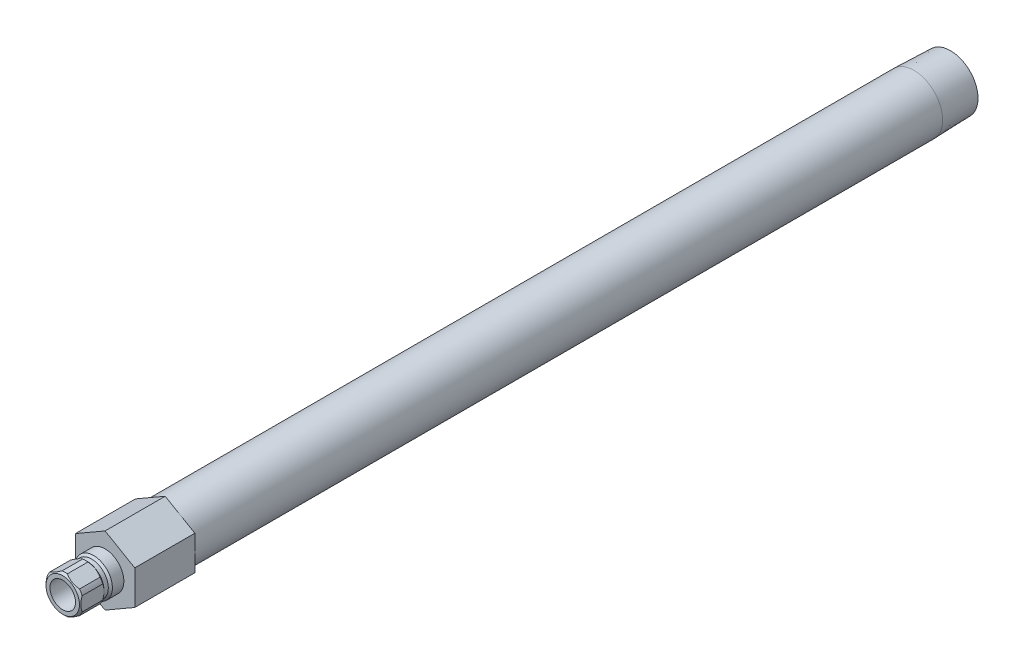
ISO-10303-21;
HEADER;
FILE_DESCRIPTION(('STEP AP214'),'2;1');
FILE_NAME('part.step','',(''),(''),'','','');
FILE_SCHEMA(('AUTOMOTIVE_DESIGN { 1 0 10303 214 1 1 1 1 }'));
ENDSEC;
DATA;
#1=APPLICATION_CONTEXT('core data for automotive mechanical design processes');
#2=APPLICATION_PROTOCOL_DEFINITION('international standard','automotive_design',2000,#1);
#3=PRODUCT_CONTEXT('',#1,'mechanical');
#4=PRODUCT('Part','Part','',(#3));
#5=PRODUCT_RELATED_PRODUCT_CATEGORY('part','',(#4));
#6=PRODUCT_DEFINITION_FORMATION('','',#4);
#7=PRODUCT_DEFINITION_CONTEXT('part definition',#1,'design');
#8=PRODUCT_DEFINITION('design','',#6,#7);
#9=PRODUCT_DEFINITION_SHAPE('','',#8);
#10=(LENGTH_UNIT() NAMED_UNIT(*) SI_UNIT(.MILLI.,.METRE.));
#11=(NAMED_UNIT(*) PLANE_ANGLE_UNIT() SI_UNIT($,.RADIAN.));
#12=(NAMED_UNIT(*) SI_UNIT($,.STERADIAN.) SOLID_ANGLE_UNIT());
#13=UNCERTAINTY_MEASURE_WITH_UNIT(LENGTH_MEASURE(1.E-05),#10,'distance_accuracy_value','');
#14=(GEOMETRIC_REPRESENTATION_CONTEXT(3) GLOBAL_UNCERTAINTY_ASSIGNED_CONTEXT((#13)) GLOBAL_UNIT_ASSIGNED_CONTEXT((#10,
#11,#12)) REPRESENTATION_CONTEXT('',''));
#15=CARTESIAN_POINT('',(0.,0.,0.));
#16=DIRECTION('',(0.,0.,1.));
#17=DIRECTION('',(1.,0.,0.));
#18=AXIS2_PLACEMENT_3D('',#15,#16,#17);
#19=CARTESIAN_POINT('',(0.,0.,13.1223734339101));
#20=DIRECTION('',(0.,0.,-1.));
#21=DIRECTION('',(0.,1.,0.));
#22=AXIS2_PLACEMENT_3D('',#19,#20,#21);
#23=CYLINDRICAL_SURFACE('',#22,6.985);
#24=DIRECTION('',(0.,0.,-1.));
#25=VECTOR('',#24,1.);
#26=CARTESIAN_POINT('',(5.50323442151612,-4.30170151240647,13.1223734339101));
#27=LINE('',#26,#25);
#28=CARTESIAN_POINT('',(5.50323442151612,-4.30170151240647,7.366));
#29=VERTEX_POINT('',#28);
#30=CARTESIAN_POINT('',(5.50323442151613,-4.30170151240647,14.986));
#31=VERTEX_POINT('',#30);
#32=EDGE_CURVE('E406',#29,#31,#27,.F.);
#33=ORIENTED_EDGE('',*,*,#32,.F.);
#34=CARTESIAN_POINT('',(0.,0.,7.366));
#35=DIRECTION('',(0.,0.,-1.));
#36=DIRECTION('',(0.,1.,0.));
#37=AXIS2_PLACEMENT_3D('',#34,#35,#36);
#38=CIRCLE('',#37,6.985);
#39=CARTESIAN_POINT('',(6.477,-2.61509005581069,7.366));
#40=VERTEX_POINT('',#39);
#41=EDGE_CURVE('E383',#40,#29,#38,.T.);
#42=ORIENTED_EDGE('',*,*,#41,.F.);
#43=DIRECTION('',(0.,0.,-1.));
#44=VECTOR('',#43,1.);
#45=CARTESIAN_POINT('',(6.477,-2.61509005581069,13.1223734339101));
#46=LINE('',#45,#44);
#47=CARTESIAN_POINT('',(6.477,-2.6150900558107,14.986));
#48=VERTEX_POINT('',#47);
#49=EDGE_CURVE('E397',#48,#40,#46,.T.);
#50=ORIENTED_EDGE('',*,*,#49,.F.);
#51=CARTESIAN_POINT('',(0.,0.,14.986));
#52=DIRECTION('',(0.,0.,-1.));
#53=DIRECTION('',(0.,1.,0.));
#54=AXIS2_PLACEMENT_3D('',#51,#52,#53);
#55=CIRCLE('',#54,6.985);
#56=EDGE_CURVE('E191',#48,#31,#55,.T.);
#57=ORIENTED_EDGE('',*,*,#56,.T.);
#58=EDGE_LOOP('',(#33,#42,#50,#57));
#59=FACE_BOUND('',#58,.T.);
#60=ADVANCED_FACE('F34',(#59),#23,.T.);
#61=DIRECTION('',(0.,0.,-1.));
#62=VECTOR('',#61,1.);
#63=CARTESIAN_POINT('',(6.477,2.6150900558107,13.1223734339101));
#64=LINE('',#63,#62);
#65=CARTESIAN_POINT('',(6.477,2.6150900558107,7.366));
#66=VERTEX_POINT('',#65);
#67=CARTESIAN_POINT('',(6.477,2.6150900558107,14.986));
#68=VERTEX_POINT('',#67);
#69=EDGE_CURVE('E309',#66,#68,#64,.F.);
#70=ORIENTED_EDGE('',*,*,#69,.F.);
#71=CARTESIAN_POINT('',(5.50323442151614,4.30170151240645,7.366));
#72=VERTEX_POINT('',#71);
#73=EDGE_CURVE('E204',#72,#66,#38,.T.);
#74=ORIENTED_EDGE('',*,*,#73,.F.);
#75=DIRECTION('',(0.,0.,-1.));
#76=VECTOR('',#75,1.);
#77=CARTESIAN_POINT('',(5.50323442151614,4.30170151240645,13.1223734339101));
#78=LINE('',#77,#76);
#79=CARTESIAN_POINT('',(5.50323442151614,4.30170151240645,14.986));
#80=VERTEX_POINT('',#79);
#81=EDGE_CURVE('E394',#80,#72,#78,.T.);
#82=ORIENTED_EDGE('',*,*,#81,.F.);
#83=EDGE_CURVE('E198',#80,#68,#55,.T.);
#84=ORIENTED_EDGE('',*,*,#83,.T.);
#85=EDGE_LOOP('',(#70,#74,#82,#84));
#86=FACE_BOUND('',#85,.T.);
#87=ADVANCED_FACE('F343',(#86),#23,.T.);
#88=DIRECTION('',(0.,0.,-1.));
#89=VECTOR('',#88,1.);
#90=CARTESIAN_POINT('',(0.973765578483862,6.91679156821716,13.1223734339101));
#91=LINE('',#90,#89);
#92=CARTESIAN_POINT('',(0.973765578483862,6.91679156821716,7.366));
#93=VERTEX_POINT('',#92);
#94=CARTESIAN_POINT('',(0.973765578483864,6.91679156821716,14.986));
#95=VERTEX_POINT('',#94);
#96=EDGE_CURVE('E399',#93,#95,#91,.F.);
#97=ORIENTED_EDGE('',*,*,#96,.F.);
#98=CARTESIAN_POINT('',(-0.973765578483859,6.91679156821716,7.366));
#99=VERTEX_POINT('',#98);
#100=EDGE_CURVE('E200',#99,#93,#38,.T.);
#101=ORIENTED_EDGE('',*,*,#100,.F.);
#102=DIRECTION('',(0.,0.,-1.));
#103=VECTOR('',#102,1.);
#104=CARTESIAN_POINT('',(-0.973765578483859,6.91679156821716,13.1223734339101));
#105=LINE('',#104,#103);
#106=CARTESIAN_POINT('',(-0.973765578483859,6.91679156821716,14.986));
#107=VERTEX_POINT('',#106);
#108=EDGE_CURVE('E375',#107,#99,#105,.T.);
#109=ORIENTED_EDGE('',*,*,#108,.F.);
#110=EDGE_CURVE('E193',#107,#95,#55,.T.);
#111=ORIENTED_EDGE('',*,*,#110,.T.);
#112=EDGE_LOOP('',(#97,#101,#109,#111));
#113=FACE_BOUND('',#112,.T.);
#114=ADVANCED_FACE('F348',(#113),#23,.T.);
#115=DIRECTION('',(0.,0.,-1.));
#116=VECTOR('',#115,1.);
#117=CARTESIAN_POINT('',(-5.50323442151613,4.30170151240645,13.1223734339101));
#118=LINE('',#117,#116);
#119=CARTESIAN_POINT('',(-5.50323442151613,4.30170151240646,7.366));
#120=VERTEX_POINT('',#119);
#121=CARTESIAN_POINT('',(-5.50323442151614,4.30170151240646,14.986));
#122=VERTEX_POINT('',#121);
#123=EDGE_CURVE('E54',#120,#122,#118,.F.);
#124=ORIENTED_EDGE('',*,*,#123,.F.);
#125=CARTESIAN_POINT('',(-6.477,2.6150900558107,7.366));
#126=VERTEX_POINT('',#125);
#127=EDGE_CURVE('E203',#126,#120,#38,.T.);
#128=ORIENTED_EDGE('',*,*,#127,.F.);
#129=DIRECTION('',(0.,0.,-1.));
#130=VECTOR('',#129,1.);
#131=CARTESIAN_POINT('',(-6.477,2.6150900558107,13.1223734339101));
#132=LINE('',#131,#130);
#133=CARTESIAN_POINT('',(-6.477,2.61509005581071,14.986));
#134=VERTEX_POINT('',#133);
#135=EDGE_CURVE('E263',#134,#126,#132,.T.);
#136=ORIENTED_EDGE('',*,*,#135,.F.);
#137=EDGE_CURVE('E189',#134,#122,#55,.T.);
#138=ORIENTED_EDGE('',*,*,#137,.T.);
#139=EDGE_LOOP('',(#124,#128,#136,#138));
#140=FACE_BOUND('',#139,.T.);
#141=ADVANCED_FACE('F360',(#140),#23,.T.);
#142=DIRECTION('',(0.,0.,-1.));
#143=VECTOR('',#142,1.);
#144=CARTESIAN_POINT('',(-6.477,-2.6150900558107,13.1223734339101));
#145=LINE('',#144,#143);
#146=CARTESIAN_POINT('',(-6.477,-2.61509005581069,7.366));
#147=VERTEX_POINT('',#146);
#148=CARTESIAN_POINT('',(-6.477,-2.6150900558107,14.986));
#149=VERTEX_POINT('',#148);
#150=EDGE_CURVE('E62',#147,#149,#145,.F.);
#151=ORIENTED_EDGE('',*,*,#150,.F.);
#152=CARTESIAN_POINT('',(-5.50323442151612,-4.30170151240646,7.366));
#153=VERTEX_POINT('',#152);
#154=EDGE_CURVE('E182',#153,#147,#38,.T.);
#155=ORIENTED_EDGE('',*,*,#154,.F.);
#156=DIRECTION('',(0.,0.,-1.));
#157=VECTOR('',#156,1.);
#158=CARTESIAN_POINT('',(-5.50323442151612,-4.30170151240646,13.1223734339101));
#159=LINE('',#158,#157);
#160=CARTESIAN_POINT('',(-5.50323442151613,-4.30170151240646,14.986));
#161=VERTEX_POINT('',#160);
#162=EDGE_CURVE('E165',#161,#153,#159,.T.);
#163=ORIENTED_EDGE('',*,*,#162,.F.);
#164=EDGE_CURVE('E180',#161,#149,#55,.T.);
#165=ORIENTED_EDGE('',*,*,#164,.T.);
#166=EDGE_LOOP('',(#151,#155,#163,#165));
#167=FACE_BOUND('',#166,.T.);
#168=ADVANCED_FACE('F179',(#167),#23,.T.);
#169=CARTESIAN_POINT('',(0.,0.,13.1223734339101));
#170=DIRECTION('',(0.,0.,-1.));
#171=DIRECTION('',(0.,1.,0.));
#172=AXIS2_PLACEMENT_3D('',#169,#170,#171);
#173=CYLINDRICAL_SURFACE('',#172,10.6679999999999);
#174=CARTESIAN_POINT('',(0.,1.44365591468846E-13,-300.8884));
#175=DIRECTION('',(0.,0.,-1.));
#176=DIRECTION('',(0.,1.,0.));
#177=AXIS2_PLACEMENT_3D('',#174,#175,#176);
#178=CIRCLE('',#177,10.6679999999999);
#179=CARTESIAN_POINT('',(0.,10.668,-300.8884));
#180=VERTEX_POINT('',#179);
#181=EDGE_CURVE('E217',#180,#180,#178,.T.);
#182=ORIENTED_EDGE('',*,*,#181,.F.);
#183=EDGE_LOOP('',(#182));
#184=FACE_BOUND('',#183,.T.);
#185=CARTESIAN_POINT('',(0.,0.,-22.352));
#186=DIRECTION('',(0.,0.,1.));
#187=DIRECTION('',(1.,0.,0.));
#188=AXIS2_PLACEMENT_3D('',#185,#186,#187);
#189=CIRCLE('',#188,10.6679999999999);
#190=CARTESIAN_POINT('',(10.6679999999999,0.,-22.352));
#191=VERTEX_POINT('',#190);
#192=EDGE_CURVE('E231',#191,#191,#189,.F.);
#193=ORIENTED_EDGE('',*,*,#192,.T.);
#194=EDGE_LOOP('',(#193));
#195=FACE_BOUND('',#194,.T.);
#196=ADVANCED_FACE('F359',(#184,#195),#173,.T.);
#197=CARTESIAN_POINT('',(0.,0.,13.1223734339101));
#198=DIRECTION('',(0.,0.,-1.));
#199=DIRECTION('',(0.,1.,0.));
#200=AXIS2_PLACEMENT_3D('',#197,#198,#199);
#201=CYLINDRICAL_SURFACE('',#200,4.76249999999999);
#202=CARTESIAN_POINT('',(0.,0.,15.748));
#203=DIRECTION('',(0.,0.,-1.));
#204=DIRECTION('',(0.,1.,0.));
#205=AXIS2_PLACEMENT_3D('',#202,#203,#204);
#206=CIRCLE('',#205,4.7625);
#207=CARTESIAN_POINT('',(0.,4.7625,15.748));
#208=VERTEX_POINT('',#207);
#209=EDGE_CURVE('E233',#208,#208,#206,.T.);
#210=ORIENTED_EDGE('',*,*,#209,.F.);
#211=EDGE_LOOP('',(#210));
#212=FACE_BOUND('',#211,.T.);
#213=CARTESIAN_POINT('',(0.,0.,-22.352));
#214=DIRECTION('',(0.,0.,-1.));
#215=DIRECTION('',(0.,1.,0.));
#216=AXIS2_PLACEMENT_3D('',#213,#214,#215);
#217=CIRCLE('',#216,4.76249999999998);
#218=CARTESIAN_POINT('',(0.,4.7625,-22.352));
#219=VERTEX_POINT('',#218);
#220=EDGE_CURVE('E174',#219,#219,#217,.T.);
#221=ORIENTED_EDGE('',*,*,#220,.T.);
#222=EDGE_LOOP('',(#221));
#223=FACE_BOUND('',#222,.T.);
#224=ADVANCED_FACE('F36',(#212,#223),#201,.F.);
#225=CARTESIAN_POINT('',(0.,4.7625,-22.352));
#226=DIRECTION('',(0.,0.,-1.));
#227=DIRECTION('',(0.,1.,0.));
#228=AXIS2_PLACEMENT_3D('',#225,#226,#227);
#229=PLANE('',#228);
#230=CARTESIAN_POINT('',(0.,0.,-22.352));
#231=DIRECTION('',(0.,0.,-1.));
#232=DIRECTION('',(0.,1.,0.));
#233=AXIS2_PLACEMENT_3D('',#230,#231,#232);
#234=CIRCLE('',#233,7.89939999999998);
#235=CARTESIAN_POINT('',(0.,7.8994,-22.352));
#236=VERTEX_POINT('',#235);
#237=EDGE_CURVE('E226',#236,#236,#234,.T.);
#238=ORIENTED_EDGE('',*,*,#237,.T.);
#239=EDGE_LOOP('',(#238));
#240=FACE_BOUND('',#239,.T.);
#241=ORIENTED_EDGE('',*,*,#220,.F.);
#242=EDGE_LOOP('',(#241));
#243=FACE_BOUND('',#242,.T.);
#244=ADVANCED_FACE('F533',(#240,#243),#229,.T.);
#245=CARTESIAN_POINT('',(0.,0.,13.1223734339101));
#246=DIRECTION('',(0.,0.,-1.));
#247=DIRECTION('',(0.,1.,0.));
#248=AXIS2_PLACEMENT_3D('',#245,#246,#247);
#249=CYLINDRICAL_SURFACE('',#248,7.89939999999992);
#250=CARTESIAN_POINT('',(0.,1.50525101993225E-13,-314.452));
#251=DIRECTION('',(0.,0.,-1.));
#252=DIRECTION('',(0.,1.,0.));
#253=AXIS2_PLACEMENT_3D('',#250,#251,#252);
#254=CIRCLE('',#253,7.89939999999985);
#255=CARTESIAN_POINT('',(0.,7.8994,-314.452));
#256=VERTEX_POINT('',#255);
#257=EDGE_CURVE('E223',#256,#256,#254,.T.);
#258=ORIENTED_EDGE('',*,*,#257,.T.);
#259=EDGE_LOOP('',(#258));
#260=FACE_BOUND('',#259,.T.);
#261=ORIENTED_EDGE('',*,*,#237,.F.);
#262=EDGE_LOOP('',(#261));
#263=FACE_BOUND('',#262,.T.);
#264=ADVANCED_FACE('F530',(#260,#263),#249,.F.);
#265=CARTESIAN_POINT('',(0.,10.244140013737,-314.452));
#266=DIRECTION('',(0.,0.,-1.));
#267=DIRECTION('',(0.,1.,0.));
#268=AXIS2_PLACEMENT_3D('',#265,#266,#267);
#269=PLANE('',#268);
#270=CARTESIAN_POINT('',(0.,1.50525101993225E-13,-314.452));
#271=DIRECTION('',(0.,0.,-1.));
#272=DIRECTION('',(0.,1.,0.));
#273=AXIS2_PLACEMENT_3D('',#270,#271,#272);
#274=CIRCLE('',#273,10.2441400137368);
#275=CARTESIAN_POINT('',(0.,10.244140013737,-314.452));
#276=VERTEX_POINT('',#275);
#277=EDGE_CURVE('E220',#276,#276,#274,.T.);
#278=ORIENTED_EDGE('',*,*,#277,.T.);
#279=EDGE_LOOP('',(#278));
#280=FACE_BOUND('',#279,.T.);
#281=ORIENTED_EDGE('',*,*,#257,.F.);
#282=EDGE_LOOP('',(#281));
#283=FACE_BOUND('',#282,.T.);
#284=ADVANCED_FACE('F524',(#280,#283),#269,.T.);
#285=CARTESIAN_POINT('',(0.,1.50525101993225E-13,-314.452));
#286=DIRECTION('',(0.,0.,1.));
#287=DIRECTION('',(0.,-1.,0.));
#288=AXIS2_PLACEMENT_3D('',#285,#286,#287);
#289=CONICAL_SURFACE('',#288,10.2441400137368,0.0312396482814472);
#290=ORIENTED_EDGE('',*,*,#181,.T.);
#291=EDGE_LOOP('',(#290));
#292=FACE_BOUND('',#291,.T.);
#293=ORIENTED_EDGE('',*,*,#277,.F.);
#294=EDGE_LOOP('',(#293));
#295=FACE_BOUND('',#294,.T.);
#296=ADVANCED_FACE('F514',(#292,#295),#289,.T.);
#297=CARTESIAN_POINT('',(0.,6.985,0.));
#298=DIRECTION('',(0.,0.,1.));
#299=DIRECTION('',(0.,-1.,0.));
#300=AXIS2_PLACEMENT_3D('',#297,#298,#299);
#301=PLANE('',#300);
#302=CARTESIAN_POINT('',(0.,0.,0.));
#303=DIRECTION('',(0.,0.,-1.));
#304=DIRECTION('',(0.,1.,0.));
#305=AXIS2_PLACEMENT_3D('',#302,#303,#304);
#306=CIRCLE('',#305,6.98499999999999);
#307=CARTESIAN_POINT('',(0.,6.985,0.));
#308=VERTEX_POINT('',#307);
#309=EDGE_CURVE('E214',#308,#308,#306,.T.);
#310=ORIENTED_EDGE('',*,*,#309,.T.);
#311=EDGE_LOOP('',(#310));
#312=FACE_BOUND('',#311,.T.);
#313=DIRECTION('',(-0.866025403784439,-0.5,0.));
#314=VECTOR('',#313,1.);
#315=CARTESIAN_POINT('',(0.,12.7582862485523,0.));
#316=LINE('',#315,#314);
#317=CARTESIAN_POINT('',(0.,12.7582862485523,0.));
#318=VERTEX_POINT('',#317);
#319=CARTESIAN_POINT('',(-11.049,6.37914312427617,0.));
#320=VERTEX_POINT('',#319);
#321=EDGE_CURVE('E409',#318,#320,#316,.T.);
#322=ORIENTED_EDGE('',*,*,#321,.T.);
#323=DIRECTION('',(0.,-1.,0.));
#324=VECTOR('',#323,1.);
#325=CARTESIAN_POINT('',(-11.049,6.37914312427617,0.));
#326=LINE('',#325,#324);
#327=CARTESIAN_POINT('',(-11.049,-6.37914312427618,0.));
#328=VERTEX_POINT('',#327);
#329=EDGE_CURVE('E436',#320,#328,#326,.T.);
#330=ORIENTED_EDGE('',*,*,#329,.T.);
#331=DIRECTION('',(0.866025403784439,-0.5,0.));
#332=VECTOR('',#331,1.);
#333=CARTESIAN_POINT('',(-11.049,-6.37914312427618,0.));
#334=LINE('',#333,#332);
#335=CARTESIAN_POINT('',(0.,-12.7582862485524,0.));
#336=VERTEX_POINT('',#335);
#337=EDGE_CURVE('E439',#328,#336,#334,.T.);
#338=ORIENTED_EDGE('',*,*,#337,.T.);
#339=DIRECTION('',(0.866025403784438,0.5,0.));
#340=VECTOR('',#339,1.);
#341=CARTESIAN_POINT('',(0.,-12.7582862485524,0.));
#342=LINE('',#341,#340);
#343=CARTESIAN_POINT('',(11.049,-6.37914312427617,0.));
#344=VERTEX_POINT('',#343);
#345=EDGE_CURVE('E442',#336,#344,#342,.T.);
#346=ORIENTED_EDGE('',*,*,#345,.T.);
#347=DIRECTION('',(0.,1.,0.));
#348=VECTOR('',#347,1.);
#349=CARTESIAN_POINT('',(11.049,-6.37914312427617,0.));
#350=LINE('',#349,#348);
#351=CARTESIAN_POINT('',(11.049,6.37914312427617,0.));
#352=VERTEX_POINT('',#351);
#353=EDGE_CURVE('E445',#344,#352,#350,.T.);
#354=ORIENTED_EDGE('',*,*,#353,.T.);
#355=DIRECTION('',(-0.866025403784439,0.5,0.));
#356=VECTOR('',#355,1.);
#357=CARTESIAN_POINT('',(11.049,6.37914312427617,0.));
#358=LINE('',#357,#356);
#359=EDGE_CURVE('E418',#352,#318,#358,.T.);
#360=ORIENTED_EDGE('',*,*,#359,.T.);
#361=EDGE_LOOP('',(#322,#330,#338,#346,#354,#360));
#362=FACE_BOUND('',#361,.T.);
#363=ADVANCED_FACE('F511',(#312,#362),#301,.T.);
#364=CARTESIAN_POINT('',(0.,0.,13.1223734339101));
#365=DIRECTION('',(0.,0.,-1.));
#366=DIRECTION('',(0.,1.,0.));
#367=AXIS2_PLACEMENT_3D('',#364,#365,#366);
#368=CYLINDRICAL_SURFACE('',#367,6.98499999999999);
#369=CARTESIAN_POINT('',(0.,0.,4.25449999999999));
#370=DIRECTION('',(0.,0.,-1.));
#371=DIRECTION('',(0.,1.,0.));
#372=AXIS2_PLACEMENT_3D('',#369,#370,#371);
#373=CIRCLE('',#372,6.98499999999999);
#374=CARTESIAN_POINT('',(0.,6.985,4.2545));
#375=VERTEX_POINT('',#374);
#376=EDGE_CURVE('E211',#375,#375,#373,.T.);
#377=ORIENTED_EDGE('',*,*,#376,.T.);
#378=EDGE_LOOP('',(#377));
#379=FACE_BOUND('',#378,.T.);
#380=ORIENTED_EDGE('',*,*,#309,.F.);
#381=EDGE_LOOP('',(#380));
#382=FACE_BOUND('',#381,.T.);
#383=ADVANCED_FACE('F513',(#379,#382),#368,.T.);
#384=CARTESIAN_POINT('',(0.,0.,4.25449999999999));
#385=DIRECTION('',(0.,0.,-1.));
#386=DIRECTION('',(0.,1.,0.));
#387=AXIS2_PLACEMENT_3D('',#384,#385,#386);
#388=CONICAL_SURFACE('',#387,6.98499999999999,0.785398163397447);
#389=CARTESIAN_POINT('',(0.,0.,5.0165));
#390=DIRECTION('',(0.,0.,-1.));
#391=DIRECTION('',(0.,1.,0.));
#392=AXIS2_PLACEMENT_3D('',#389,#390,#391);
#393=CIRCLE('',#392,6.223);
#394=CARTESIAN_POINT('',(0.,6.223,5.0165));
#395=VERTEX_POINT('',#394);
#396=EDGE_CURVE('E208',#395,#395,#393,.T.);
#397=ORIENTED_EDGE('',*,*,#396,.T.);
#398=EDGE_LOOP('',(#397));
#399=FACE_BOUND('',#398,.T.);
#400=ORIENTED_EDGE('',*,*,#376,.F.);
#401=EDGE_LOOP('',(#400));
#402=FACE_BOUND('',#401,.T.);
#403=ADVANCED_FACE('F521',(#399,#402),#388,.T.);
#404=CARTESIAN_POINT('',(0.,0.,13.1223734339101));
#405=DIRECTION('',(0.,0.,-1.));
#406=DIRECTION('',(0.,1.,0.));
#407=AXIS2_PLACEMENT_3D('',#404,#405,#406);
#408=CYLINDRICAL_SURFACE('',#407,6.223);
#409=CARTESIAN_POINT('',(0.,0.,6.604));
#410=DIRECTION('',(0.,0.,-1.));
#411=DIRECTION('',(0.,1.,0.));
#412=AXIS2_PLACEMENT_3D('',#409,#410,#411);
#413=CIRCLE('',#412,6.223);
#414=CARTESIAN_POINT('',(0.,6.223,6.604));
#415=VERTEX_POINT('',#414);
#416=EDGE_CURVE('E205',#415,#415,#413,.T.);
#417=ORIENTED_EDGE('',*,*,#416,.T.);
#418=EDGE_LOOP('',(#417));
#419=FACE_BOUND('',#418,.T.);
#420=ORIENTED_EDGE('',*,*,#396,.F.);
#421=EDGE_LOOP('',(#420));
#422=FACE_BOUND('',#421,.T.);
#423=ADVANCED_FACE('F270',(#419,#422),#408,.T.);
#424=CARTESIAN_POINT('',(0.,0.,6.604));
#425=DIRECTION('',(0.,0.,1.));
#426=DIRECTION('',(0.,-1.,0.));
#427=AXIS2_PLACEMENT_3D('',#424,#425,#426);
#428=CONICAL_SURFACE('',#427,6.223,0.785398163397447);
#429=CARTESIAN_POINT('',(0.97330298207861,-6.91705864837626,7.3662));
#430=CARTESIAN_POINT('',(1.15430521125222,-6.81255696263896,7.28788330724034));
#431=CARTESIAN_POINT('',(1.33782092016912,-6.70660411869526,7.21664558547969));
#432=CARTESIAN_POINT('',(1.70963160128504,-6.49193912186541,7.09114753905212));
#433=CARTESIAN_POINT('',(1.89793754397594,-6.38322063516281,7.03693086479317));
#434=CARTESIAN_POINT('',(2.27146153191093,-6.16756646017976,6.95027563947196));
#435=CARTESIAN_POINT('',(2.45655498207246,-6.06070270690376,6.91713772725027));
#436=CARTESIAN_POINT('',(2.82844640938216,-5.8459910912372,6.87178043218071));
#437=CARTESIAN_POINT('',(3.01524193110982,-5.73814464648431,6.85953461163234));
#438=CARTESIAN_POINT('',(3.39480578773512,-5.51900335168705,6.85669437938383));
#439=CARTESIAN_POINT('',(3.58757842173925,-5.40770601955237,6.86678827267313));
#440=CARTESIAN_POINT('',(3.97148128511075,-5.18605959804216,6.9093291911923));
#441=CARTESIAN_POINT('',(4.16260891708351,-5.07571200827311,6.9418066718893));
#442=CARTESIAN_POINT('',(4.54854122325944,-4.85289388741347,7.02857263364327));
#443=CARTESIAN_POINT('',(4.74321398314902,-4.74049951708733,7.08363522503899));
#444=CARTESIAN_POINT('',(5.03141021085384,-4.57410934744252,7.17999209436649));
#445=CARTESIAN_POINT('',(5.12673323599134,-4.51907457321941,7.21435772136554));
#446=CARTESIAN_POINT('',(5.31613879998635,-4.40972121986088,7.28725547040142));
#447=CARTESIAN_POINT('',(5.41022179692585,-4.3554023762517,7.32578600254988));
#448=CARTESIAN_POINT('',(5.50369701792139,-4.30143443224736,7.3662));
#449=B_SPLINE_CURVE_WITH_KNOTS('',3,(#429,#430,#431,#432,#433,#434,#435,#436,#437,#438,#439,
#440,#441,#442,#443,#444,#445,#446,#447,#448),.UNSPECIFIED.,.F.,.F.,(4,2,2,2,2,2,2,2,2,4),(0.,
0.669810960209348,1.34132587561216,1.9892054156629,2.63626449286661,3.30353665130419,
3.97171850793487,4.66502165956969,5.01088265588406,5.35661208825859),.UNSPECIFIED.);
#450=CARTESIAN_POINT('',(0.973765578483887,-6.91679156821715,7.366));
#451=VERTEX_POINT('',#450);
#452=EDGE_CURVE('E408',#451,#29,#449,.T.);
#453=ORIENTED_EDGE('',*,*,#452,.F.);
#454=CARTESIAN_POINT('',(-0.97376557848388,-6.91679156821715,7.366));
#455=VERTEX_POINT('',#454);
#456=EDGE_CURVE('E381',#451,#455,#38,.T.);
#457=ORIENTED_EDGE('',*,*,#456,.T.);
#458=CARTESIAN_POINT('',(-5.50369701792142,-4.30143443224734,7.36620000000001));
#459=CARTESIAN_POINT('',(-5.32269478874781,-4.40593611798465,7.28788330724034));
#460=CARTESIAN_POINT('',(-5.13917907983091,-4.51188896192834,7.2166455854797));
#461=CARTESIAN_POINT('',(-4.76736839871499,-4.7265539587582,7.09114753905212));
#462=CARTESIAN_POINT('',(-4.57906245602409,-4.83527244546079,7.03693086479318));
#463=CARTESIAN_POINT('',(-4.20553846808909,-5.05092662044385,6.95027563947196));
#464=CARTESIAN_POINT('',(-4.02044501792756,-5.15779037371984,6.91713772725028));
#465=CARTESIAN_POINT('',(-3.64855359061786,-5.37250198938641,6.87178043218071));
#466=CARTESIAN_POINT('',(-3.4617580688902,-5.48034843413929,6.85953461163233));
#467=CARTESIAN_POINT('',(-3.0821942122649,-5.69948972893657,6.85669437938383));
#468=CARTESIAN_POINT('',(-2.88942157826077,-5.81078706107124,6.86678827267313));
#469=CARTESIAN_POINT('',(-2.50551871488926,-6.03243348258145,6.90932919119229));
#470=CARTESIAN_POINT('',(-2.3143910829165,-6.1427810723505,6.9418066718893));
#471=CARTESIAN_POINT('',(-1.92845877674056,-6.36559919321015,7.02857263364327));
#472=CARTESIAN_POINT('',(-1.73378601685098,-6.47799356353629,7.08363522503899));
#473=CARTESIAN_POINT('',(-1.44558978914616,-6.6443837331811,7.17999209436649));
#474=CARTESIAN_POINT('',(-1.35026676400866,-6.69941850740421,7.21435772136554));
#475=CARTESIAN_POINT('',(-1.16086120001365,-6.80877186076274,7.28725547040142));
#476=CARTESIAN_POINT('',(-1.06677820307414,-6.86309070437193,7.32578600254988));
#477=CARTESIAN_POINT('',(-0.973302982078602,-6.91705864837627,7.3662));
#478=B_SPLINE_CURVE_WITH_KNOTS('',3,(#458,#459,#460,#461,#462,#463,#464,#465,#466,#467,#468,
#469,#470,#471,#472,#473,#474,#475,#476,#477),.UNSPECIFIED.,.F.,.F.,(4,2,2,2,2,2,2,2,2,4),(0.,
0.669810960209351,1.34132587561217,1.98920541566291,2.63626449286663,3.30353665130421,
3.97171850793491,4.66502165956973,5.0108826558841,5.35661208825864),.UNSPECIFIED.);
#479=EDGE_CURVE('E256',#153,#455,#478,.T.);
#480=ORIENTED_EDGE('',*,*,#479,.F.);
#481=ORIENTED_EDGE('',*,*,#154,.T.);
#482=CARTESIAN_POINT('',(-6.477,-7.50531717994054,10.2946933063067));
#483=CARTESIAN_POINT('',(-6.477,-7.32278230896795,10.1565337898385));
#484=CARTESIAN_POINT('',(-6.477,-7.13923073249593,10.0196957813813));
#485=CARTESIAN_POINT('',(-6.477,-6.76969107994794,9.74925615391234));
#486=CARTESIAN_POINT('',(-6.477,-6.58370240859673,9.61565534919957));
#487=CARTESIAN_POINT('',(-6.477,-6.20752484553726,9.35133325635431));
#488=CARTESIAN_POINT('',(-6.477,-6.01731457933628,9.22064228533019));
#489=CARTESIAN_POINT('',(-6.477,-5.63367369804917,8.96409124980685));
#490=CARTESIAN_POINT('',(-6.477,-5.44024331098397,8.83823084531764));
#491=CARTESIAN_POINT('',(-6.477,-5.03831720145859,8.58528971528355));
#492=CARTESIAN_POINT('',(-6.477,-4.8295984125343,8.45856164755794));
#493=CARTESIAN_POINT('',(-6.477,-4.4072839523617,8.21337587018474));
#494=CARTESIAN_POINT('',(-6.477,-4.19368750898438,8.09491948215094));
#495=CARTESIAN_POINT('',(-6.477,-3.7616267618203,7.8688284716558));
#496=CARTESIAN_POINT('',(-6.477,-3.54317924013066,7.76116202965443));
#497=CARTESIAN_POINT('',(-6.477,-3.100295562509,7.55906153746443));
#498=CARTESIAN_POINT('',(-6.477,-2.87586219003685,7.46462146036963));
#499=CARTESIAN_POINT('',(-6.477,-2.43955826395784,7.2995033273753));
#500=CARTESIAN_POINT('',(-6.477,-2.22819339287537,7.2275028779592));
#501=CARTESIAN_POINT('',(-6.477,-1.80033354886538,7.10045249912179));
#502=CARTESIAN_POINT('',(-6.477,-1.58383822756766,7.0454037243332));
#503=CARTESIAN_POINT('',(-6.477,-1.15063390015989,6.95606140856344));
#504=CARTESIAN_POINT('',(-6.477,-0.934000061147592,6.92140936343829));
#505=CARTESIAN_POINT('',(-6.477,-0.498364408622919,6.87354056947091));
#506=CARTESIAN_POINT('',(-6.477,-0.279363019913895,6.86032003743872));
#507=CARTESIAN_POINT('',(-6.477,0.150697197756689,6.85631642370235));
#508=CARTESIAN_POINT('',(-6.477,0.361748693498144,6.8647176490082));
#509=CARTESIAN_POINT('',(-6.477,0.782066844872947,6.90168275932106));
#510=CARTESIAN_POINT('',(-6.477,0.991333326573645,6.93024858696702));
#511=CARTESIAN_POINT('',(-6.477,1.41010575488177,7.00646246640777));
#512=CARTESIAN_POINT('',(-6.477,1.61955133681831,7.05443689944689));
#513=CARTESIAN_POINT('',(-6.477,2.03387291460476,7.16689535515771));
#514=CARTESIAN_POINT('',(-6.477,2.23874927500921,7.2313780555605));
#515=CARTESIAN_POINT('',(-6.477,2.66141718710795,7.38044013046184));
#516=CARTESIAN_POINT('',(-6.477,2.87875617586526,7.46628961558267));
#517=CARTESIAN_POINT('',(-6.477,3.30779766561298,7.65118196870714));
#518=CARTESIAN_POINT('',(-6.477,3.51949749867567,7.75023095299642));
#519=CARTESIAN_POINT('',(-6.477,3.93828980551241,7.95916705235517));
#520=CARTESIAN_POINT('',(-6.477,4.14536521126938,8.06908810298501));
#521=CARTESIAN_POINT('',(-6.477,4.5547539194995,8.2973403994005));
#522=CARTESIAN_POINT('',(-6.477,4.75706796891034,8.41567031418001));
#523=CARTESIAN_POINT('',(-6.477,5.1476137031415,8.65303908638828));
#524=CARTESIAN_POINT('',(-6.477,5.33604552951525,8.77175038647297));
#525=CARTESIAN_POINT('',(-6.477,5.70967381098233,9.01417488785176));
#526=CARTESIAN_POINT('',(-6.477,5.89487001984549,9.13788846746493));
#527=CARTESIAN_POINT('',(-6.477,6.26095063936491,9.38840412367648));
#528=CARTESIAN_POINT('',(-6.477,6.44185783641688,9.51517302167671));
#529=CARTESIAN_POINT('',(-6.477,6.80119835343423,9.77207065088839));
#530=CARTESIAN_POINT('',(-6.477,6.97963234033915,9.90219844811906));
#531=CARTESIAN_POINT('',(-6.477,7.1570303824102,10.0336997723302));
#532=B_SPLINE_CURVE_WITH_KNOTS('',3,(#482,#483,#484,#485,#486,#487,#488,#489,#490,#491,#492,
#493,#494,#495,#496,#497,#498,#499,#500,#501,#502,#503,#504,#505,#506,#507,#508,#509,#510,#511,
#512,#513,#514,#515,#516,#517,#518,#519,#520,#521,#522,#523,#524,#525,#526,#527,#528,#529,#530,
#531),.UNSPECIFIED.,.F.,.F.,(4,2,2,2,2,2,2,2,2,2,2,2,2,2,2,2,2,2,2,2,2,2,2,2,4),(0.,
0.686790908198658,1.37375281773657,2.06603541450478,2.75826919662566,3.49065471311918,
4.22315698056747,4.95343127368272,5.68337170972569,6.35265989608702,7.02199365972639,
7.67918147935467,8.33625327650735,8.96890298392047,9.60161364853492,10.2454384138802,
10.8892116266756,11.5897073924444,12.2905288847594,12.9936114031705,13.6965828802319,
14.3646145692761,15.0326968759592,15.6953618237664,16.3578444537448),.UNSPECIFIED.);
#533=EDGE_CURVE('E279',#126,#147,#532,.F.);
#534=ORIENTED_EDGE('',*,*,#533,.F.);
#535=ORIENTED_EDGE('',*,*,#127,.T.);
#536=CARTESIAN_POINT('',(-0.97330298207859,6.91705864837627,7.3662));
#537=CARTESIAN_POINT('',(-1.1543052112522,6.81255696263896,7.28788330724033));
#538=CARTESIAN_POINT('',(-1.3378209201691,6.70660411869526,7.21664558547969));
#539=CARTESIAN_POINT('',(-1.70963160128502,6.49193912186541,7.09114753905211));
#540=CARTESIAN_POINT('',(-1.89793754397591,6.38322063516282,7.03693086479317));
#541=CARTESIAN_POINT('',(-2.27146153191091,6.16756646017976,6.95027563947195));
#542=CARTESIAN_POINT('',(-2.45655498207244,6.06070270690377,6.91713772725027));
#543=CARTESIAN_POINT('',(-2.82844640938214,5.8459910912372,6.87178043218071));
#544=CARTESIAN_POINT('',(-3.0152419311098,5.73814464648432,6.85953461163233));
#545=CARTESIAN_POINT('',(-3.3948057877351,5.51900335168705,6.85669437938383));
#546=CARTESIAN_POINT('',(-3.58757842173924,5.40770601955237,6.86678827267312));
#547=CARTESIAN_POINT('',(-3.97148128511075,5.18605959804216,6.90932919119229));
#548=CARTESIAN_POINT('',(-4.16260891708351,5.07571200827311,6.94180667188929));
#549=CARTESIAN_POINT('',(-4.54854122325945,4.85289388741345,7.02857263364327));
#550=CARTESIAN_POINT('',(-4.74321398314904,4.74049951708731,7.08363522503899));
#551=CARTESIAN_POINT('',(-5.03141021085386,4.5741093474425,7.17999209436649));
#552=CARTESIAN_POINT('',(-5.12673323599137,4.51907457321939,7.21435772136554));
#553=CARTESIAN_POINT('',(-5.31613879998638,4.40972121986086,7.28725547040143));
#554=CARTESIAN_POINT('',(-5.41022179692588,4.35540237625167,7.32578600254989));
#555=CARTESIAN_POINT('',(-5.50369701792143,4.30143443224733,7.36620000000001));
#556=B_SPLINE_CURVE_WITH_KNOTS('',3,(#536,#537,#538,#539,#540,#541,#542,#543,#544,#545,#546,
#547,#548,#549,#550,#551,#552,#553,#554,#555),.UNSPECIFIED.,.F.,.F.,(4,2,2,2,2,2,2,2,2,4),(0.,
0.669810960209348,1.34132587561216,1.9892054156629,2.63626449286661,3.3035366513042,
3.97171850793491,4.66502165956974,5.01088265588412,5.35661208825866),.UNSPECIFIED.);
#557=EDGE_CURVE('E286',#99,#120,#556,.T.);
#558=ORIENTED_EDGE('',*,*,#557,.F.);
#559=ORIENTED_EDGE('',*,*,#100,.T.);
#560=CARTESIAN_POINT('',(5.5036970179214,4.30143443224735,7.3662));
#561=CARTESIAN_POINT('',(5.32269478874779,4.40593611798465,7.28788330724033));
#562=CARTESIAN_POINT('',(5.13917907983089,4.51188896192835,7.21664558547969));
#563=CARTESIAN_POINT('',(4.76736839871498,4.7265539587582,7.09114753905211));
#564=CARTESIAN_POINT('',(4.57906245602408,4.8352724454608,7.03693086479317));
#565=CARTESIAN_POINT('',(4.20553846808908,5.05092662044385,6.95027563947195));
#566=CARTESIAN_POINT('',(4.02044501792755,5.15779037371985,6.91713772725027));
#567=CARTESIAN_POINT('',(3.64855359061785,5.37250198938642,6.87178043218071));
#568=CARTESIAN_POINT('',(3.46175806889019,5.4803484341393,6.85953461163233));
#569=CARTESIAN_POINT('',(3.08219421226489,5.69948972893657,6.85669437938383));
#570=CARTESIAN_POINT('',(2.88942157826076,5.81078706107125,6.86678827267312));
#571=CARTESIAN_POINT('',(2.50551871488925,6.03243348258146,6.90932919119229));
#572=CARTESIAN_POINT('',(2.31439108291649,6.1427810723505,6.94180667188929));
#573=CARTESIAN_POINT('',(1.92845877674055,6.36559919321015,7.02857263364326));
#574=CARTESIAN_POINT('',(1.73378601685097,6.47799356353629,7.08363522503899));
#575=CARTESIAN_POINT('',(1.44558978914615,6.64438373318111,7.17999209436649));
#576=CARTESIAN_POINT('',(1.35026676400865,6.69941850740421,7.21435772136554));
#577=CARTESIAN_POINT('',(1.16086120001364,6.80877186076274,7.28725547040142));
#578=CARTESIAN_POINT('',(1.06677820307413,6.86309070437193,7.32578600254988));
#579=CARTESIAN_POINT('',(0.973302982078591,6.91705864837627,7.3662));
#580=B_SPLINE_CURVE_WITH_KNOTS('',3,(#560,#561,#562,#563,#564,#565,#566,#567,#568,#569,#570,
#571,#572,#573,#574,#575,#576,#577,#578,#579),.UNSPECIFIED.,.F.,.F.,(4,2,2,2,2,2,2,2,2,4),(0.,
0.669810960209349,1.34132587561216,1.9892054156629,2.63626449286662,3.3035366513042,
3.9717185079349,4.66502165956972,5.0108826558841,5.35661208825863),.UNSPECIFIED.);
#581=EDGE_CURVE('E293',#72,#93,#580,.T.);
#582=ORIENTED_EDGE('',*,*,#581,.F.);
#583=ORIENTED_EDGE('',*,*,#73,.T.);
#584=CARTESIAN_POINT('',(6.477,-7.50531717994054,10.2946933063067));
#585=CARTESIAN_POINT('',(6.477,-7.32278230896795,10.1565337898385));
#586=CARTESIAN_POINT('',(6.477,-7.13923073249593,10.0196957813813));
#587=CARTESIAN_POINT('',(6.477,-6.76969107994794,9.74925615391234));
#588=CARTESIAN_POINT('',(6.477,-6.58370240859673,9.61565534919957));
#589=CARTESIAN_POINT('',(6.477,-6.20752484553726,9.35133325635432));
#590=CARTESIAN_POINT('',(6.477,-6.01731457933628,9.22064228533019));
#591=CARTESIAN_POINT('',(6.477,-5.63367369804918,8.96409124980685));
#592=CARTESIAN_POINT('',(6.477,-5.44024331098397,8.83823084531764));
#593=CARTESIAN_POINT('',(6.477,-5.03831720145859,8.58528971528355));
#594=CARTESIAN_POINT('',(6.477,-4.82959841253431,8.45856164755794));
#595=CARTESIAN_POINT('',(6.477,-4.4072839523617,8.21337587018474));
#596=CARTESIAN_POINT('',(6.477,-4.19368750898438,8.09491948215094));
#597=CARTESIAN_POINT('',(6.477,-3.76162676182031,7.8688284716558));
#598=CARTESIAN_POINT('',(6.477,-3.54317924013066,7.76116202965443));
#599=CARTESIAN_POINT('',(6.477,-3.100295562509,7.55906153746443));
#600=CARTESIAN_POINT('',(6.477,-2.87586219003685,7.46462146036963));
#601=CARTESIAN_POINT('',(6.477,-2.43955826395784,7.2995033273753));
#602=CARTESIAN_POINT('',(6.477,-2.22819339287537,7.2275028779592));
#603=CARTESIAN_POINT('',(6.477,-1.80033354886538,7.10045249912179));
#604=CARTESIAN_POINT('',(6.477,-1.58383822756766,7.0454037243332));
#605=CARTESIAN_POINT('',(6.477,-1.15063390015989,6.95606140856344));
#606=CARTESIAN_POINT('',(6.477,-0.934000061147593,6.92140936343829));
#607=CARTESIAN_POINT('',(6.477,-0.498364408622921,6.87354056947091));
#608=CARTESIAN_POINT('',(6.477,-0.279363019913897,6.86032003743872));
#609=CARTESIAN_POINT('',(6.477,0.150697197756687,6.85631642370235));
#610=CARTESIAN_POINT('',(6.477,0.361748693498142,6.8647176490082));
#611=CARTESIAN_POINT('',(6.477,0.782066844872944,6.90168275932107));
#612=CARTESIAN_POINT('',(6.477,0.991333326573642,6.93024858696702));
#613=CARTESIAN_POINT('',(6.477,1.41010575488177,7.00646246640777));
#614=CARTESIAN_POINT('',(6.477,1.6195513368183,7.05443689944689));
#615=CARTESIAN_POINT('',(6.477,2.03387291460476,7.16689535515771));
#616=CARTESIAN_POINT('',(6.477,2.23874927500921,7.2313780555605));
#617=CARTESIAN_POINT('',(6.477,2.66141718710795,7.38044013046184));
#618=CARTESIAN_POINT('',(6.477,2.87875617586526,7.46628961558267));
#619=CARTESIAN_POINT('',(6.477,3.30779766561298,7.65118196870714));
#620=CARTESIAN_POINT('',(6.477,3.51949749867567,7.75023095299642));
#621=CARTESIAN_POINT('',(6.477,3.93828980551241,7.95916705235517));
#622=CARTESIAN_POINT('',(6.477,4.14536521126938,8.06908810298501));
#623=CARTESIAN_POINT('',(6.477,4.5547539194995,8.2973403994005));
#624=CARTESIAN_POINT('',(6.477,4.75706796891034,8.41567031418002));
#625=CARTESIAN_POINT('',(6.477,5.1476137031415,8.65303908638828));
#626=CARTESIAN_POINT('',(6.477,5.33604552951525,8.77175038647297));
#627=CARTESIAN_POINT('',(6.477,5.70967381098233,9.01417488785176));
#628=CARTESIAN_POINT('',(6.477,5.8948700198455,9.13788846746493));
#629=CARTESIAN_POINT('',(6.477,6.26095063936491,9.38840412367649));
#630=CARTESIAN_POINT('',(6.477,6.44185783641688,9.51517302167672));
#631=CARTESIAN_POINT('',(6.477,6.80119835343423,9.77207065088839));
#632=CARTESIAN_POINT('',(6.477,6.97963234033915,9.90219844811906));
#633=CARTESIAN_POINT('',(6.477,7.1570303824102,10.0336997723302));
#634=B_SPLINE_CURVE_WITH_KNOTS('',3,(#584,#585,#586,#587,#588,#589,#590,#591,#592,#593,#594,
#595,#596,#597,#598,#599,#600,#601,#602,#603,#604,#605,#606,#607,#608,#609,#610,#611,#612,#613,
#614,#615,#616,#617,#618,#619,#620,#621,#622,#623,#624,#625,#626,#627,#628,#629,#630,#631,#632,
#633),.UNSPECIFIED.,.F.,.F.,(4,2,2,2,2,2,2,2,2,2,2,2,2,2,2,2,2,2,2,2,2,2,2,2,4),(0.,
0.68679090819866,1.37375281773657,2.06603541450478,2.75826919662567,3.49065471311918,
4.22315698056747,4.95343127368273,5.6833717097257,6.35265989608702,7.02199365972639,
7.67918147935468,8.33625327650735,8.96890298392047,9.60161364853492,10.2454384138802,
10.8892116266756,11.5897073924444,12.2905288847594,12.9936114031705,13.696582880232,
14.3646145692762,15.0326968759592,15.6953618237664,16.3578444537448),.UNSPECIFIED.);
#635=EDGE_CURVE('E301',#40,#66,#634,.T.);
#636=ORIENTED_EDGE('',*,*,#635,.F.);
#637=ORIENTED_EDGE('',*,*,#41,.T.);
#638=EDGE_LOOP('',(#453,#457,#480,#481,#534,#535,#558,#559,#582,#583,#636,#637));
#639=FACE_BOUND('',#638,.T.);
#640=ORIENTED_EDGE('',*,*,#416,.F.);
#641=EDGE_LOOP('',(#640));
#642=FACE_BOUND('',#641,.T.);
#643=ADVANCED_FACE('F265',(#639,#642),#428,.T.);
#644=DIRECTION('',(0.,0.,-1.));
#645=VECTOR('',#644,1.);
#646=CARTESIAN_POINT('',(0.973765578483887,-6.91679156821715,13.1223734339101));
#647=LINE('',#646,#645);
#648=CARTESIAN_POINT('',(0.973765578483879,-6.91679156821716,14.986));
#649=VERTEX_POINT('',#648);
#650=EDGE_CURVE('E308',#649,#451,#647,.T.);
#651=ORIENTED_EDGE('',*,*,#650,.F.);
#652=CARTESIAN_POINT('',(-0.973765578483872,-6.91679156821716,14.986));
#653=VERTEX_POINT('',#652);
#654=EDGE_CURVE('E188',#649,#653,#55,.T.);
#655=ORIENTED_EDGE('',*,*,#654,.T.);
#656=DIRECTION('',(0.,0.,-1.));
#657=VECTOR('',#656,1.);
#658=CARTESIAN_POINT('',(-0.97376557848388,-6.91679156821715,13.1223734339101));
#659=LINE('',#658,#657);
#660=EDGE_CURVE('E168',#455,#653,#659,.F.);
#661=ORIENTED_EDGE('',*,*,#660,.F.);
#662=ORIENTED_EDGE('',*,*,#456,.F.);
#663=EDGE_LOOP('',(#651,#655,#661,#662));
#664=FACE_BOUND('',#663,.T.);
#665=ADVANCED_FACE('F269',(#664),#23,.T.);
#666=CARTESIAN_POINT('',(0.,0.,14.986));
#667=DIRECTION('',(0.,0.,-1.));
#668=DIRECTION('',(0.,1.,0.));
#669=AXIS2_PLACEMENT_3D('',#666,#667,#668);
#670=CONICAL_SURFACE('',#669,6.985,0.785398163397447);
#671=CARTESIAN_POINT('',(5.50369701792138,-4.30143443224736,14.9858));
#672=CARTESIAN_POINT('',(5.32269478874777,-4.40593611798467,15.0641166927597));
#673=CARTESIAN_POINT('',(5.13917907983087,-4.51188896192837,15.1353544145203));
#674=CARTESIAN_POINT('',(4.76736839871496,-4.72655395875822,15.2608524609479));
#675=CARTESIAN_POINT('',(4.57906245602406,-4.83527244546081,15.3150691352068));
#676=CARTESIAN_POINT('',(4.20553846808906,-5.05092662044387,15.401724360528));
#677=CARTESIAN_POINT('',(4.02044501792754,-5.15779037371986,15.4348622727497));
#678=CARTESIAN_POINT('',(3.64855359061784,-5.37250198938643,15.4802195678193));
#679=CARTESIAN_POINT('',(3.46175806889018,-5.48034843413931,15.4924653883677));
#680=CARTESIAN_POINT('',(3.08219421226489,-5.69948972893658,15.4953056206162));
#681=CARTESIAN_POINT('',(2.88942157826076,-5.81078706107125,15.4852117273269));
#682=CARTESIAN_POINT('',(2.50551871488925,-6.03243348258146,15.4426708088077));
#683=CARTESIAN_POINT('',(2.3143910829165,-6.14278107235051,15.4101933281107));
#684=CARTESIAN_POINT('',(1.92845877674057,-6.36559919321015,15.3234273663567));
#685=CARTESIAN_POINT('',(1.73378601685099,-6.47799356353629,15.268364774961));
#686=CARTESIAN_POINT('',(1.44558978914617,-6.6443837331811,15.1720079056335));
#687=CARTESIAN_POINT('',(1.35026676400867,-6.6994185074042,15.1376422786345));
#688=CARTESIAN_POINT('',(1.16086120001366,-6.80877186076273,15.0647445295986));
#689=CARTESIAN_POINT('',(1.06677820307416,-6.86309070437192,15.0262139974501));
#690=CARTESIAN_POINT('',(0.973302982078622,-6.91705864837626,14.9858));
#691=B_SPLINE_CURVE_WITH_KNOTS('',3,(#671,#672,#673,#674,#675,#676,#677,#678,#679,#680,#681,
#682,#683,#684,#685,#686,#687,#688,#689,#690),.UNSPECIFIED.,.F.,.F.,(4,2,2,2,2,2,2,2,2,4),(0.,
0.669810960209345,1.34132587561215,1.98920541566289,2.6362644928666,3.30353665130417,
3.97171850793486,4.66502165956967,5.01088265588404,5.35661208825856),.UNSPECIFIED.);
#692=EDGE_CURVE('E12',#31,#649,#691,.T.);
#693=ORIENTED_EDGE('',*,*,#692,.F.);
#694=ORIENTED_EDGE('',*,*,#56,.F.);
#695=CARTESIAN_POINT('',(6.477,-7.50531717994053,12.0573066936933));
#696=CARTESIAN_POINT('',(6.477,-7.32278230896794,12.1954662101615));
#697=CARTESIAN_POINT('',(6.477,-7.13923073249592,12.3323042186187));
#698=CARTESIAN_POINT('',(6.477,-6.76969107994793,12.6027438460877));
#699=CARTESIAN_POINT('',(6.477,-6.58370240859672,12.7363446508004));
#700=CARTESIAN_POINT('',(6.477,-6.20752484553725,13.0006667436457));
#701=CARTESIAN_POINT('',(6.477,-6.01731457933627,13.1313577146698));
#702=CARTESIAN_POINT('',(6.477,-5.63367369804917,13.3879087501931));
#703=CARTESIAN_POINT('',(6.477,-5.44024331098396,13.5137691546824));
#704=CARTESIAN_POINT('',(6.477,-5.03831720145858,13.7667102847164));
#705=CARTESIAN_POINT('',(6.477,-4.8295984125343,13.893438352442));
#706=CARTESIAN_POINT('',(6.477,-4.4072839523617,14.1386241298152));
#707=CARTESIAN_POINT('',(6.477,-4.19368750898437,14.2570805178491));
#708=CARTESIAN_POINT('',(6.477,-3.7616267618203,14.4831715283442));
#709=CARTESIAN_POINT('',(6.477,-3.54317924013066,14.5908379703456));
#710=CARTESIAN_POINT('',(6.477,-3.100295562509,14.7929384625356));
#711=CARTESIAN_POINT('',(6.477,-2.87586219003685,14.8873785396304));
#712=CARTESIAN_POINT('',(6.477,-2.43955826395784,15.0524966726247));
#713=CARTESIAN_POINT('',(6.477,-2.22819339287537,15.1244971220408));
#714=CARTESIAN_POINT('',(6.477,-1.80033354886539,15.2515475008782));
#715=CARTESIAN_POINT('',(6.477,-1.58383822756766,15.3065962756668));
#716=CARTESIAN_POINT('',(6.477,-1.1506339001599,15.3959385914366));
#717=CARTESIAN_POINT('',(6.477,-0.934000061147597,15.4305906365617));
#718=CARTESIAN_POINT('',(6.477,-0.498364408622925,15.4784594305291));
#719=CARTESIAN_POINT('',(6.477,-0.279363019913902,15.4916799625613));
#720=CARTESIAN_POINT('',(6.477,0.150697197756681,15.4956835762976));
#721=CARTESIAN_POINT('',(6.477,0.361748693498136,15.4872823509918));
#722=CARTESIAN_POINT('',(6.477,0.782066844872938,15.4503172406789));
#723=CARTESIAN_POINT('',(6.477,0.991333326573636,15.421751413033));
#724=CARTESIAN_POINT('',(6.477,1.41010575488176,15.3455375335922));
#725=CARTESIAN_POINT('',(6.477,1.6195513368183,15.2975631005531));
#726=CARTESIAN_POINT('',(6.477,2.03387291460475,15.1851046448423));
#727=CARTESIAN_POINT('',(6.477,2.2387492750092,15.1206219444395));
#728=CARTESIAN_POINT('',(6.477,2.66141718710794,14.9715598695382));
#729=CARTESIAN_POINT('',(6.477,2.87875617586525,14.8857103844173));
#730=CARTESIAN_POINT('',(6.477,3.30779766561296,14.7008180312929));
#731=CARTESIAN_POINT('',(6.477,3.51949749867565,14.6017690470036));
#732=CARTESIAN_POINT('',(6.477,3.93828980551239,14.3928329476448));
#733=CARTESIAN_POINT('',(6.477,4.14536521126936,14.282911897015));
#734=CARTESIAN_POINT('',(6.477,4.55475391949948,14.0546596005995));
#735=CARTESIAN_POINT('',(6.477,4.75706796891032,13.93632968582));
#736=CARTESIAN_POINT('',(6.477,5.14761370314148,13.6989609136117));
#737=CARTESIAN_POINT('',(6.477,5.33604552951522,13.580249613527));
#738=CARTESIAN_POINT('',(6.477,5.70967381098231,13.3378251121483));
#739=CARTESIAN_POINT('',(6.477,5.89487001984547,13.2141115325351));
#740=CARTESIAN_POINT('',(6.477,6.26095063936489,12.9635958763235));
#741=CARTESIAN_POINT('',(6.477,6.44185783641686,12.8368269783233));
#742=CARTESIAN_POINT('',(6.477,6.80119835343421,12.5799293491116));
#743=CARTESIAN_POINT('',(6.477,6.97963234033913,12.449801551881));
#744=CARTESIAN_POINT('',(6.477,7.15703038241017,12.3183002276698));
#745=B_SPLINE_CURVE_WITH_KNOTS('',3,(#695,#696,#697,#698,#699,#700,#701,#702,#703,#704,#705,
#706,#707,#708,#709,#710,#711,#712,#713,#714,#715,#716,#717,#718,#719,#720,#721,#722,#723,#724,
#725,#726,#727,#728,#729,#730,#731,#732,#733,#734,#735,#736,#737,#738,#739,#740,#741,#742,#743,
#744),.UNSPECIFIED.,.F.,.F.,(4,2,2,2,2,2,2,2,2,2,2,2,2,2,2,2,2,2,2,2,2,2,2,2,4),(0.,
0.686790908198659,1.37375281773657,2.06603541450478,2.75826919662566,3.49065471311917,
4.22315698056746,4.95343127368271,5.68337170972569,6.35265989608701,7.02199365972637,
7.67918147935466,8.33625327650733,8.96890298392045,9.6016136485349,10.2454384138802,
10.8892116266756,11.5897073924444,12.2905288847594,12.9936114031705,13.6965828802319,
14.3646145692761,15.0326968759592,15.6953618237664,16.3578444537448),.UNSPECIFIED.);
#746=EDGE_CURVE('E47',#68,#48,#745,.F.);
#747=ORIENTED_EDGE('',*,*,#746,.F.);
#748=ORIENTED_EDGE('',*,*,#83,.F.);
#749=CARTESIAN_POINT('',(0.973302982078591,6.91705864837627,14.9858));
#750=CARTESIAN_POINT('',(1.15430521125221,6.81255696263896,15.0641166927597));
#751=CARTESIAN_POINT('',(1.33782092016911,6.70660411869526,15.1353544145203));
#752=CARTESIAN_POINT('',(1.70963160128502,6.49193912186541,15.2608524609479));
#753=CARTESIAN_POINT('',(1.89793754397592,6.38322063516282,15.3150691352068));
#754=CARTESIAN_POINT('',(2.27146153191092,6.16756646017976,15.401724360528));
#755=CARTESIAN_POINT('',(2.45655498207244,6.06070270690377,15.4348622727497));
#756=CARTESIAN_POINT('',(2.82844640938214,5.8459910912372,15.4802195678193));
#757=CARTESIAN_POINT('',(3.0152419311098,5.73814464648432,15.4924653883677));
#758=CARTESIAN_POINT('',(3.3948057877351,5.51900335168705,15.4953056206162));
#759=CARTESIAN_POINT('',(3.58757842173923,5.40770601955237,15.4852117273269));
#760=CARTESIAN_POINT('',(3.97148128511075,5.18605959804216,15.4426708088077));
#761=CARTESIAN_POINT('',(4.16260891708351,5.07571200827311,15.4101933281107));
#762=CARTESIAN_POINT('',(4.54854122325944,4.85289388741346,15.3234273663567));
#763=CARTESIAN_POINT('',(4.74321398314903,4.74049951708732,15.268364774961));
#764=CARTESIAN_POINT('',(5.03141021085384,4.57410934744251,15.1720079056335));
#765=CARTESIAN_POINT('',(5.12673323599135,4.5190745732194,15.1376422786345));
#766=CARTESIAN_POINT('',(5.31613879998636,4.40972121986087,15.0647445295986));
#767=CARTESIAN_POINT('',(5.41022179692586,4.35540237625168,15.0262139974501));
#768=CARTESIAN_POINT('',(5.5036970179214,4.30143443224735,14.9858));
#769=B_SPLINE_CURVE_WITH_KNOTS('',3,(#749,#750,#751,#752,#753,#754,#755,#756,#757,#758,#759,
#760,#761,#762,#763,#764,#765,#766,#767,#768),.UNSPECIFIED.,.F.,.F.,(4,2,2,2,2,2,2,2,2,4),(0.,
0.669810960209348,1.34132587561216,1.98920541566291,2.63626449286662,3.3035366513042,
3.9717185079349,4.66502165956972,5.01088265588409,5.35661208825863),.UNSPECIFIED.);
#770=EDGE_CURVE('E325',#95,#80,#769,.T.);
#771=ORIENTED_EDGE('',*,*,#770,.F.);
#772=ORIENTED_EDGE('',*,*,#110,.F.);
#773=CARTESIAN_POINT('',(-5.50369701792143,4.30143443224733,14.9858));
#774=CARTESIAN_POINT('',(-5.32269478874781,4.40593611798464,15.0641166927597));
#775=CARTESIAN_POINT('',(-5.13917907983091,4.51188896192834,15.1353544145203));
#776=CARTESIAN_POINT('',(-4.767368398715,4.72655395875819,15.2608524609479));
#777=CARTESIAN_POINT('',(-4.5790624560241,4.83527244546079,15.3150691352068));
#778=CARTESIAN_POINT('',(-4.20553846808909,5.05092662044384,15.401724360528));
#779=CARTESIAN_POINT('',(-4.02044501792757,5.15779037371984,15.4348622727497));
#780=CARTESIAN_POINT('',(-3.64855359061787,5.37250198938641,15.4802195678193));
#781=CARTESIAN_POINT('',(-3.46175806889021,5.48034843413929,15.4924653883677));
#782=CARTESIAN_POINT('',(-3.0821942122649,5.69948972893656,15.4953056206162));
#783=CARTESIAN_POINT('',(-2.88942157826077,5.81078706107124,15.4852117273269));
#784=CARTESIAN_POINT('',(-2.50551871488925,6.03243348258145,15.4426708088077));
#785=CARTESIAN_POINT('',(-2.31439108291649,6.1427810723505,15.4101933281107));
#786=CARTESIAN_POINT('',(-1.92845877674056,6.36559919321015,15.3234273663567));
#787=CARTESIAN_POINT('',(-1.73378601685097,6.47799356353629,15.268364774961));
#788=CARTESIAN_POINT('',(-1.44558978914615,6.6443837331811,15.1720079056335));
#789=CARTESIAN_POINT('',(-1.35026676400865,6.69941850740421,15.1376422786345));
#790=CARTESIAN_POINT('',(-1.16086120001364,6.80877186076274,15.0647445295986));
#791=CARTESIAN_POINT('',(-1.06677820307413,6.86309070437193,15.0262139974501));
#792=CARTESIAN_POINT('',(-0.973302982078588,6.91705864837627,14.9858));
#793=B_SPLINE_CURVE_WITH_KNOTS('',3,(#773,#774,#775,#776,#777,#778,#779,#780,#781,#782,#783,
#784,#785,#786,#787,#788,#789,#790,#791,#792),.UNSPECIFIED.,.F.,.F.,(4,2,2,2,2,2,2,2,2,4),(0.,
0.669810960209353,1.34132587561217,1.98920541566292,2.63626449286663,3.30353665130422,
3.97171850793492,4.66502165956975,5.01088265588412,5.35661208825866),.UNSPECIFIED.);
#794=EDGE_CURVE('E329',#122,#107,#793,.T.);
#795=ORIENTED_EDGE('',*,*,#794,.F.);
#796=ORIENTED_EDGE('',*,*,#137,.F.);
#797=CARTESIAN_POINT('',(-6.477,-7.50531717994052,12.0573066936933));
#798=CARTESIAN_POINT('',(-6.477,-7.32278230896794,12.1954662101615));
#799=CARTESIAN_POINT('',(-6.477,-7.13923073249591,12.3323042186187));
#800=CARTESIAN_POINT('',(-6.477,-6.76969107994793,12.6027438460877));
#801=CARTESIAN_POINT('',(-6.477,-6.58370240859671,12.7363446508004));
#802=CARTESIAN_POINT('',(-6.477,-6.20752484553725,13.0006667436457));
#803=CARTESIAN_POINT('',(-6.477,-6.01731457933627,13.1313577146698));
#804=CARTESIAN_POINT('',(-6.477,-5.63367369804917,13.3879087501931));
#805=CARTESIAN_POINT('',(-6.477,-5.44024331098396,13.5137691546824));
#806=CARTESIAN_POINT('',(-6.477,-5.03831720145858,13.7667102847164));
#807=CARTESIAN_POINT('',(-6.477,-4.8295984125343,13.893438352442));
#808=CARTESIAN_POINT('',(-6.477,-4.40728395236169,14.1386241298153));
#809=CARTESIAN_POINT('',(-6.477,-4.19368750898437,14.2570805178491));
#810=CARTESIAN_POINT('',(-6.477,-3.7616267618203,14.4831715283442));
#811=CARTESIAN_POINT('',(-6.477,-3.54317924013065,14.5908379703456));
#812=CARTESIAN_POINT('',(-6.477,-3.100295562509,14.7929384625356));
#813=CARTESIAN_POINT('',(-6.477,-2.87586219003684,14.8873785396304));
#814=CARTESIAN_POINT('',(-6.477,-2.43955826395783,15.0524966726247));
#815=CARTESIAN_POINT('',(-6.477,-2.22819339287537,15.1244971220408));
#816=CARTESIAN_POINT('',(-6.477,-1.80033354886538,15.2515475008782));
#817=CARTESIAN_POINT('',(-6.477,-1.58383822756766,15.3065962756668));
#818=CARTESIAN_POINT('',(-6.477,-1.15063390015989,15.3959385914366));
#819=CARTESIAN_POINT('',(-6.477,-0.934000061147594,15.4305906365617));
#820=CARTESIAN_POINT('',(-6.477,-0.498364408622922,15.4784594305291));
#821=CARTESIAN_POINT('',(-6.477,-0.279363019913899,15.4916799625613));
#822=CARTESIAN_POINT('',(-6.477,0.150697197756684,15.4956835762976));
#823=CARTESIAN_POINT('',(-6.477,0.36174869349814,15.4872823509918));
#824=CARTESIAN_POINT('',(-6.477,0.782066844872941,15.4503172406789));
#825=CARTESIAN_POINT('',(-6.477,0.991333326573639,15.421751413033));
#826=CARTESIAN_POINT('',(-6.477,1.41010575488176,15.3455375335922));
#827=CARTESIAN_POINT('',(-6.477,1.6195513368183,15.2975631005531));
#828=CARTESIAN_POINT('',(-6.477,2.03387291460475,15.1851046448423));
#829=CARTESIAN_POINT('',(-6.477,2.2387492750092,15.1206219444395));
#830=CARTESIAN_POINT('',(-6.477,2.66141718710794,14.9715598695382));
#831=CARTESIAN_POINT('',(-6.477,2.87875617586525,14.8857103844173));
#832=CARTESIAN_POINT('',(-6.477,3.30779766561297,14.7008180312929));
#833=CARTESIAN_POINT('',(-6.477,3.51949749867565,14.6017690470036));
#834=CARTESIAN_POINT('',(-6.477,3.9382898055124,14.3928329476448));
#835=CARTESIAN_POINT('',(-6.477,4.14536521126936,14.282911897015));
#836=CARTESIAN_POINT('',(-6.477,4.55475391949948,14.0546596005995));
#837=CARTESIAN_POINT('',(-6.477,4.75706796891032,13.93632968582));
#838=CARTESIAN_POINT('',(-6.477,5.14761370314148,13.6989609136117));
#839=CARTESIAN_POINT('',(-6.477,5.33604552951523,13.580249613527));
#840=CARTESIAN_POINT('',(-6.477,5.70967381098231,13.3378251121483));
#841=CARTESIAN_POINT('',(-6.477,5.89487001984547,13.2141115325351));
#842=CARTESIAN_POINT('',(-6.477,6.26095063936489,12.9635958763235));
#843=CARTESIAN_POINT('',(-6.477,6.44185783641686,12.8368269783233));
#844=CARTESIAN_POINT('',(-6.477,6.80119835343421,12.5799293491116));
#845=CARTESIAN_POINT('',(-6.477,6.97963234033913,12.449801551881));
#846=CARTESIAN_POINT('',(-6.477,7.15703038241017,12.3183002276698));
#847=B_SPLINE_CURVE_WITH_KNOTS('',3,(#797,#798,#799,#800,#801,#802,#803,#804,#805,#806,#807,
#808,#809,#810,#811,#812,#813,#814,#815,#816,#817,#818,#819,#820,#821,#822,#823,#824,#825,#826,
#827,#828,#829,#830,#831,#832,#833,#834,#835,#836,#837,#838,#839,#840,#841,#842,#843,#844,#845,
#846),.UNSPECIFIED.,.F.,.F.,(4,2,2,2,2,2,2,2,2,2,2,2,2,2,2,2,2,2,2,2,2,2,2,2,4),(0.,
0.686790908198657,1.37375281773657,2.06603541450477,2.75826919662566,3.49065471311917,
4.22315698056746,4.95343127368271,5.68337170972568,6.35265989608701,7.02199365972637,
7.67918147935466,8.33625327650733,8.96890298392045,9.6016136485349,10.2454384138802,
10.8892116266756,11.5897073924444,12.2905288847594,12.9936114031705,13.6965828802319,
14.3646145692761,15.0326968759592,15.6953618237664,16.3578444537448),.UNSPECIFIED.);
#848=EDGE_CURVE('E173',#149,#134,#847,.T.);
#849=ORIENTED_EDGE('',*,*,#848,.F.);
#850=ORIENTED_EDGE('',*,*,#164,.F.);
#851=CARTESIAN_POINT('',(-0.973302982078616,-6.91705864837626,14.9858));
#852=CARTESIAN_POINT('',(-1.15430521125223,-6.81255696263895,15.0641166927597));
#853=CARTESIAN_POINT('',(-1.33782092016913,-6.70660411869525,15.1353544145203));
#854=CARTESIAN_POINT('',(-1.70963160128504,-6.4919391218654,15.2608524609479));
#855=CARTESIAN_POINT('',(-1.89793754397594,-6.38322063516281,15.3150691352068));
#856=CARTESIAN_POINT('',(-2.27146153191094,-6.16756646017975,15.401724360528));
#857=CARTESIAN_POINT('',(-2.45655498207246,-6.06070270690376,15.4348622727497));
#858=CARTESIAN_POINT('',(-2.82844640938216,-5.84599109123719,15.4802195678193));
#859=CARTESIAN_POINT('',(-3.01524193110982,-5.73814464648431,15.4924653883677));
#860=CARTESIAN_POINT('',(-3.39480578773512,-5.51900335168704,15.4953056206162));
#861=CARTESIAN_POINT('',(-3.58757842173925,-5.40770601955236,15.4852117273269));
#862=CARTESIAN_POINT('',(-3.97148128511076,-5.18605959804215,15.4426708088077));
#863=CARTESIAN_POINT('',(-4.16260891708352,-5.07571200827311,15.4101933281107));
#864=CARTESIAN_POINT('',(-4.54854122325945,-4.85289388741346,15.3234273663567));
#865=CARTESIAN_POINT('',(-4.74321398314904,-4.74049951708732,15.268364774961));
#866=CARTESIAN_POINT('',(-5.03141021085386,-4.57410934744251,15.1720079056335));
#867=CARTESIAN_POINT('',(-5.12673323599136,-4.5190745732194,15.1376422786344));
#868=CARTESIAN_POINT('',(-5.31613879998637,-4.40972121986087,15.0647445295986));
#869=CARTESIAN_POINT('',(-5.41022179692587,-4.35540237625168,15.0262139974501));
#870=CARTESIAN_POINT('',(-5.50369701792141,-4.30143443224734,14.9858));
#871=B_SPLINE_CURVE_WITH_KNOTS('',3,(#851,#852,#853,#854,#855,#856,#857,#858,#859,#860,#861,
#862,#863,#864,#865,#866,#867,#868,#869,#870),.UNSPECIFIED.,.F.,.F.,(4,2,2,2,2,2,2,2,2,4),(0.,
0.669810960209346,1.34132587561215,1.9892054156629,2.6362644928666,3.30353665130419,
3.97171850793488,4.6650216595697,5.01088265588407,5.35661208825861),.UNSPECIFIED.);
#872=EDGE_CURVE('E162',#653,#161,#871,.T.);
#873=ORIENTED_EDGE('',*,*,#872,.F.);
#874=ORIENTED_EDGE('',*,*,#654,.F.);
#875=EDGE_LOOP('',(#693,#694,#747,#748,#771,#772,#795,#796,#849,#850,#873,#874));
#876=FACE_BOUND('',#875,.T.);
#877=CARTESIAN_POINT('',(0.,0.,15.748));
#878=DIRECTION('',(0.,0.,-1.));
#879=DIRECTION('',(0.,1.,0.));
#880=AXIS2_PLACEMENT_3D('',#877,#878,#879);
#881=CIRCLE('',#880,6.223);
#882=CARTESIAN_POINT('',(0.,6.223,15.748));
#883=VERTEX_POINT('',#882);
#884=EDGE_CURVE('E197',#883,#883,#881,.T.);
#885=ORIENTED_EDGE('',*,*,#884,.T.);
#886=EDGE_LOOP('',(#885));
#887=FACE_BOUND('',#886,.T.);
#888=ADVANCED_FACE('F185',(#876,#887),#670,.T.);
#889=CARTESIAN_POINT('',(0.,4.7625,15.748));
#890=DIRECTION('',(0.,0.,1.));
#891=DIRECTION('',(0.,-1.,0.));
#892=AXIS2_PLACEMENT_3D('',#889,#890,#891);
#893=PLANE('',#892);
#894=ORIENTED_EDGE('',*,*,#209,.T.);
#895=EDGE_LOOP('',(#894));
#896=FACE_BOUND('',#895,.T.);
#897=ORIENTED_EDGE('',*,*,#884,.F.);
#898=EDGE_LOOP('',(#897));
#899=FACE_BOUND('',#898,.T.);
#900=ADVANCED_FACE('F356',(#896,#899),#893,.T.);
#901=CARTESIAN_POINT('',(0.,12.7582862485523,-22.352));
#902=DIRECTION('',(-0.5,0.866025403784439,0.));
#903=DIRECTION('',(-0.866025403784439,-0.5,0.));
#904=AXIS2_PLACEMENT_3D('',#901,#902,#903);
#905=PLANE('',#904);
#906=ORIENTED_EDGE('',*,*,#321,.F.);
#907=DIRECTION('',(0.,0.,1.));
#908=VECTOR('',#907,1.);
#909=CARTESIAN_POINT('',(0.,12.7582862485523,-22.352));
#910=LINE('',#909,#908);
#911=CARTESIAN_POINT('',(0.,12.7582862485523,-22.352));
#912=VERTEX_POINT('',#911);
#913=EDGE_CURVE('E234',#912,#318,#910,.T.);
#914=ORIENTED_EDGE('',*,*,#913,.F.);
#915=DIRECTION('',(-0.866025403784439,-0.5,0.));
#916=VECTOR('',#915,1.);
#917=CARTESIAN_POINT('',(0.,12.7582862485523,-22.352));
#918=LINE('',#917,#916);
#919=CARTESIAN_POINT('',(-11.049,6.37914312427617,-22.352));
#920=VERTEX_POINT('',#919);
#921=EDGE_CURVE('E414',#912,#920,#918,.T.);
#922=ORIENTED_EDGE('',*,*,#921,.T.);
#923=DIRECTION('',(0.,0.,1.));
#924=VECTOR('',#923,1.);
#925=CARTESIAN_POINT('',(-11.049,6.37914312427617,-22.352));
#926=LINE('',#925,#924);
#927=EDGE_CURVE('E433',#920,#320,#926,.T.);
#928=ORIENTED_EDGE('',*,*,#927,.T.);
#929=EDGE_LOOP('',(#906,#914,#922,#928));
#930=FACE_BOUND('',#929,.T.);
#931=ADVANCED_FACE('F466',(#930),#905,.T.);
#932=CARTESIAN_POINT('',(11.049,6.37914312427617,-22.352));
#933=DIRECTION('',(0.5,0.866025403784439,0.));
#934=DIRECTION('',(-0.866025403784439,0.5,0.));
#935=AXIS2_PLACEMENT_3D('',#932,#933,#934);
#936=PLANE('',#935);
#937=ORIENTED_EDGE('',*,*,#359,.F.);
#938=DIRECTION('',(0.,0.,1.));
#939=VECTOR('',#938,1.);
#940=CARTESIAN_POINT('',(11.049,6.37914312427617,-22.352));
#941=LINE('',#940,#939);
#942=CARTESIAN_POINT('',(11.049,6.37914312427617,-22.352));
#943=VERTEX_POINT('',#942);
#944=EDGE_CURVE('E451',#943,#352,#941,.T.);
#945=ORIENTED_EDGE('',*,*,#944,.F.);
#946=DIRECTION('',(-0.866025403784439,0.5,0.));
#947=VECTOR('',#946,1.);
#948=CARTESIAN_POINT('',(11.049,6.37914312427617,-22.352));
#949=LINE('',#948,#947);
#950=EDGE_CURVE('E430',#943,#912,#949,.T.);
#951=ORIENTED_EDGE('',*,*,#950,.T.);
#952=ORIENTED_EDGE('',*,*,#913,.T.);
#953=EDGE_LOOP('',(#937,#945,#951,#952));
#954=FACE_BOUND('',#953,.T.);
#955=ADVANCED_FACE('F470',(#954),#936,.T.);
#956=CARTESIAN_POINT('',(11.049,-6.37914312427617,-22.352));
#957=DIRECTION('',(1.,0.,0.));
#958=DIRECTION('',(0.,0.,-1.));
#959=AXIS2_PLACEMENT_3D('',#956,#957,#958);
#960=PLANE('',#959);
#961=ORIENTED_EDGE('',*,*,#353,.F.);
#962=DIRECTION('',(0.,0.,1.));
#963=VECTOR('',#962,1.);
#964=CARTESIAN_POINT('',(11.049,-6.37914312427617,-22.352));
#965=LINE('',#964,#963);
#966=CARTESIAN_POINT('',(11.049,-6.37914312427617,-22.352));
#967=VERTEX_POINT('',#966);
#968=EDGE_CURVE('E453',#967,#344,#965,.T.);
#969=ORIENTED_EDGE('',*,*,#968,.F.);
#970=DIRECTION('',(0.,1.,0.));
#971=VECTOR('',#970,1.);
#972=CARTESIAN_POINT('',(11.049,-6.37914312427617,-22.352));
#973=LINE('',#972,#971);
#974=EDGE_CURVE('E427',#967,#943,#973,.T.);
#975=ORIENTED_EDGE('',*,*,#974,.T.);
#976=ORIENTED_EDGE('',*,*,#944,.T.);
#977=EDGE_LOOP('',(#961,#969,#975,#976));
#978=FACE_BOUND('',#977,.T.);
#979=ADVANCED_FACE('F485',(#978),#960,.T.);
#980=CARTESIAN_POINT('',(0.,-12.7582862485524,-22.352));
#981=DIRECTION('',(0.5,-0.866025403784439,0.));
#982=DIRECTION('',(0.866025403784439,0.5,0.));
#983=AXIS2_PLACEMENT_3D('',#980,#981,#982);
#984=PLANE('',#983);
#985=ORIENTED_EDGE('',*,*,#345,.F.);
#986=DIRECTION('',(0.,0.,1.));
#987=VECTOR('',#986,1.);
#988=CARTESIAN_POINT('',(0.,-12.7582862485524,-22.352));
#989=LINE('',#988,#987);
#990=CARTESIAN_POINT('',(0.,-12.7582862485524,-22.352));
#991=VERTEX_POINT('',#990);
#992=EDGE_CURVE('E455',#991,#336,#989,.T.);
#993=ORIENTED_EDGE('',*,*,#992,.F.);
#994=DIRECTION('',(0.866025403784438,0.5,0.));
#995=VECTOR('',#994,1.);
#996=CARTESIAN_POINT('',(0.,-12.7582862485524,-22.352));
#997=LINE('',#996,#995);
#998=EDGE_CURVE('E424',#991,#967,#997,.T.);
#999=ORIENTED_EDGE('',*,*,#998,.T.);
#1000=ORIENTED_EDGE('',*,*,#968,.T.);
#1001=EDGE_LOOP('',(#985,#993,#999,#1000));
#1002=FACE_BOUND('',#1001,.T.);
#1003=ADVANCED_FACE('F481',(#1002),#984,.T.);
#1004=CARTESIAN_POINT('',(-11.049,-6.37914312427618,-22.352));
#1005=DIRECTION('',(-0.5,-0.866025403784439,0.));
#1006=DIRECTION('',(0.866025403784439,-0.5,0.));
#1007=AXIS2_PLACEMENT_3D('',#1004,#1005,#1006);
#1008=PLANE('',#1007);
#1009=ORIENTED_EDGE('',*,*,#337,.F.);
#1010=DIRECTION('',(0.,0.,1.));
#1011=VECTOR('',#1010,1.);
#1012=CARTESIAN_POINT('',(-11.049,-6.37914312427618,-22.352));
#1013=LINE('',#1012,#1011);
#1014=CARTESIAN_POINT('',(-11.049,-6.37914312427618,-22.352));
#1015=VERTEX_POINT('',#1014);
#1016=EDGE_CURVE('E457',#1015,#328,#1013,.T.);
#1017=ORIENTED_EDGE('',*,*,#1016,.F.);
#1018=DIRECTION('',(0.866025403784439,-0.5,0.));
#1019=VECTOR('',#1018,1.);
#1020=CARTESIAN_POINT('',(-11.049,-6.37914312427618,-22.352));
#1021=LINE('',#1020,#1019);
#1022=EDGE_CURVE('E421',#1015,#991,#1021,.T.);
#1023=ORIENTED_EDGE('',*,*,#1022,.T.);
#1024=ORIENTED_EDGE('',*,*,#992,.T.);
#1025=EDGE_LOOP('',(#1009,#1017,#1023,#1024));
#1026=FACE_BOUND('',#1025,.T.);
#1027=ADVANCED_FACE('F477',(#1026),#1008,.T.);
#1028=CARTESIAN_POINT('',(-11.049,6.37914312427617,-22.352));
#1029=DIRECTION('',(-1.,0.,0.));
#1030=DIRECTION('',(0.,0.,1.));
#1031=AXIS2_PLACEMENT_3D('',#1028,#1029,#1030);
#1032=PLANE('',#1031);
#1033=ORIENTED_EDGE('',*,*,#329,.F.);
#1034=ORIENTED_EDGE('',*,*,#927,.F.);
#1035=DIRECTION('',(0.,-1.,0.));
#1036=VECTOR('',#1035,1.);
#1037=CARTESIAN_POINT('',(-11.049,6.37914312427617,-22.352));
#1038=LINE('',#1037,#1036);
#1039=EDGE_CURVE('E417',#920,#1015,#1038,.T.);
#1040=ORIENTED_EDGE('',*,*,#1039,.T.);
#1041=ORIENTED_EDGE('',*,*,#1016,.T.);
#1042=EDGE_LOOP('',(#1033,#1034,#1040,#1041));
#1043=FACE_BOUND('',#1042,.T.);
#1044=ADVANCED_FACE('F474',(#1043),#1032,.T.);
#1045=CARTESIAN_POINT('',(-11.049,6.37914312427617,-22.352));
#1046=DIRECTION('',(0.,0.,1.));
#1047=DIRECTION('',(1.,0.,0.));
#1048=AXIS2_PLACEMENT_3D('',#1045,#1046,#1047);
#1049=PLANE('',#1048);
#1050=ORIENTED_EDGE('',*,*,#192,.F.);
#1051=EDGE_LOOP('',(#1050));
#1052=FACE_BOUND('',#1051,.T.);
#1053=ORIENTED_EDGE('',*,*,#921,.F.);
#1054=ORIENTED_EDGE('',*,*,#950,.F.);
#1055=ORIENTED_EDGE('',*,*,#974,.F.);
#1056=ORIENTED_EDGE('',*,*,#998,.F.);
#1057=ORIENTED_EDGE('',*,*,#1022,.F.);
#1058=ORIENTED_EDGE('',*,*,#1039,.F.);
#1059=EDGE_LOOP('',(#1053,#1054,#1055,#1056,#1057,#1058));
#1060=FACE_BOUND('',#1059,.T.);
#1061=ADVANCED_FACE('F251',(#1052,#1060),#1049,.F.);
#1062=CARTESIAN_POINT('',(-6.477,-3.73949769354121,15.748));
#1063=DIRECTION('',(0.5,0.866025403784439,0.));
#1064=DIRECTION('',(-0.866025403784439,0.5,0.));
#1065=AXIS2_PLACEMENT_3D('',#1062,#1063,#1064);
#1066=PLANE('',#1065);
#1067=ORIENTED_EDGE('',*,*,#479,.T.);
#1068=ORIENTED_EDGE('',*,*,#660,.T.);
#1069=ORIENTED_EDGE('',*,*,#872,.T.);
#1070=ORIENTED_EDGE('',*,*,#162,.T.);
#1071=EDGE_LOOP('',(#1067,#1068,#1069,#1070));
#1072=FACE_BOUND('',#1071,.T.);
#1073=ADVANCED_FACE('F164',(#1072),#1066,.F.);
#1074=CARTESIAN_POINT('',(-6.477,3.73949769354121,15.748));
#1075=DIRECTION('',(1.,0.,0.));
#1076=DIRECTION('',(0.,1.,0.));
#1077=AXIS2_PLACEMENT_3D('',#1074,#1075,#1076);
#1078=PLANE('',#1077);
#1079=ORIENTED_EDGE('',*,*,#533,.T.);
#1080=ORIENTED_EDGE('',*,*,#150,.T.);
#1081=ORIENTED_EDGE('',*,*,#848,.T.);
#1082=ORIENTED_EDGE('',*,*,#135,.T.);
#1083=EDGE_LOOP('',(#1079,#1080,#1081,#1082));
#1084=FACE_BOUND('',#1083,.T.);
#1085=ADVANCED_FACE('F250',(#1084),#1078,.F.);
#1086=CARTESIAN_POINT('',(0.,7.47899538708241,15.748));
#1087=DIRECTION('',(0.5,-0.866025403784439,0.));
#1088=DIRECTION('',(0.866025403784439,0.5,0.));
#1089=AXIS2_PLACEMENT_3D('',#1086,#1087,#1088);
#1090=PLANE('',#1089);
#1091=ORIENTED_EDGE('',*,*,#557,.T.);
#1092=ORIENTED_EDGE('',*,*,#123,.T.);
#1093=ORIENTED_EDGE('',*,*,#794,.T.);
#1094=ORIENTED_EDGE('',*,*,#108,.T.);
#1095=EDGE_LOOP('',(#1091,#1092,#1093,#1094));
#1096=FACE_BOUND('',#1095,.T.);
#1097=ADVANCED_FACE('F333',(#1096),#1090,.F.);
#1098=CARTESIAN_POINT('',(6.477,3.7394976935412,15.748));
#1099=DIRECTION('',(-0.5,-0.866025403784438,0.));
#1100=DIRECTION('',(0.866025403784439,-0.5,0.));
#1101=AXIS2_PLACEMENT_3D('',#1098,#1099,#1100);
#1102=PLANE('',#1101);
#1103=ORIENTED_EDGE('',*,*,#581,.T.);
#1104=ORIENTED_EDGE('',*,*,#96,.T.);
#1105=ORIENTED_EDGE('',*,*,#770,.T.);
#1106=ORIENTED_EDGE('',*,*,#81,.T.);
#1107=EDGE_LOOP('',(#1103,#1104,#1105,#1106));
#1108=FACE_BOUND('',#1107,.T.);
#1109=ADVANCED_FACE('F315',(#1108),#1102,.F.);
#1110=CARTESIAN_POINT('',(6.477,-3.73949769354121,15.748));
#1111=DIRECTION('',(-1.,0.,0.));
#1112=DIRECTION('',(0.,0.,1.));
#1113=AXIS2_PLACEMENT_3D('',#1110,#1111,#1112);
#1114=PLANE('',#1113);
#1115=ORIENTED_EDGE('',*,*,#635,.T.);
#1116=ORIENTED_EDGE('',*,*,#69,.T.);
#1117=ORIENTED_EDGE('',*,*,#746,.T.);
#1118=ORIENTED_EDGE('',*,*,#49,.T.);
#1119=EDGE_LOOP('',(#1115,#1116,#1117,#1118));
#1120=FACE_BOUND('',#1119,.T.);
#1121=ADVANCED_FACE('F311',(#1120),#1114,.F.);
#1122=CARTESIAN_POINT('',(0.,-7.47899538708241,15.748));
#1123=DIRECTION('',(-0.5,0.866025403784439,0.));
#1124=DIRECTION('',(-0.866025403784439,-0.5,0.));
#1125=AXIS2_PLACEMENT_3D('',#1122,#1123,#1124);
#1126=PLANE('',#1125);
#1127=ORIENTED_EDGE('',*,*,#452,.T.);
#1128=ORIENTED_EDGE('',*,*,#32,.T.);
#1129=ORIENTED_EDGE('',*,*,#692,.T.);
#1130=ORIENTED_EDGE('',*,*,#650,.T.);
#1131=EDGE_LOOP('',(#1127,#1128,#1129,#1130));
#1132=FACE_BOUND('',#1131,.T.);
#1133=ADVANCED_FACE('F314',(#1132),#1126,.F.);
#1134=CLOSED_SHELL('',(#60,#87,#114,#141,#168,#196,#224,#244,#264,#284,#296,#363,#383,#403,#423,
#643,#665,#888,#900,#931,#955,#979,#1003,#1027,#1044,#1061,#1073,#1085,#1097,#1109,#1121,#1133));
#1135=MANIFOLD_SOLID_BREP('B2',#1134);
#1136=ADVANCED_BREP_SHAPE_REPRESENTATION('',(#18,#1135),#14);
#1137=SHAPE_DEFINITION_REPRESENTATION(#9,#1136);
ENDSEC;
END-ISO-10303-21;
